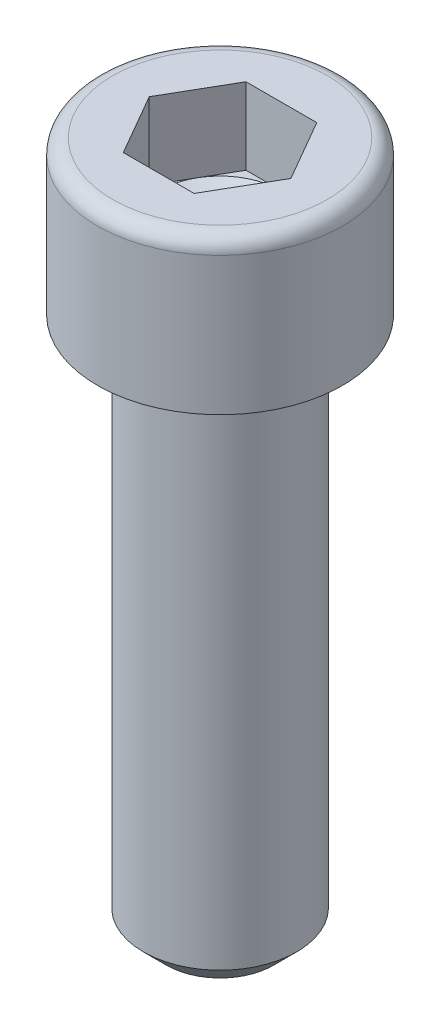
from build123d import *

# Parameters (mm, degrees)
TIGE_START              = -35
ESQUISSE1_R             = 5
TIGE_DEPTH              = 35
CHANFREIN_D_ENTR_E_SIZE = 1.5
HEXAGONE_DEPTH          = 5


with BuildPart() as part:
    # Esquisse1 → Tige (new body)
    with BuildSketch(Plane(origin=(0, 0, 0), x_dir=(1, 0, 0), z_dir=(0, 1, 0)).offset(TIGE_START)):
        with Locations(Location((0, 0, 0), (0, 0, 270))):
            Circle(ESQUISSE1_R)
    extrude(amount=TIGE_DEPTH)

    # Chanfrein d_entr_e
    chanfrein_d_entr_e_edges = [part.edges().sort_by_distance(p)[0] for p in [
        (0, -35, -5),
    ]]
    chamfer(chanfrein_d_entr_e_edges, length=CHANFREIN_D_ENTR_E_SIZE)

    # Esquisse2 → T_te (revolve)
    with BuildSketch(Plane.XY, mode=Mode.PRIVATE) as t_te_sk:
        with BuildLine():
            Line((4, 10), (4, 5))
            Line((4, 5), (0, 2.690598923))
            Line((0, 2.690598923), (0, 0))
            Line((0, 0), (8, 0))
            Line((8, 0), (8, 9))
            ThreePointArc((8, 9), (7.707106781, 9.707106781), (7, 10))
            Line((7, 10), (4, 10))
        make_face()
    revolve(t_te_sk.sketch.rotate(Axis((0, 10, 0), (0, -1, 0)), 180), axis=Axis((0, 10, 0), (0, -1, 0)))

    # Esquisse3 → Hexagone (cut)
    with BuildSketch(Plane(origin=(0, 10, -3), x_dir=(1, 0, 0), z_dir=(0, -1, 0))):
        Polygon((2.309401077, 7), (-2.309401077, 7), (-4.618802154, 3), (-2.309401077, -1), (2.309401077, -1), (4.618802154, 3), align=None)
    extrude(amount=HEXAGONE_DEPTH, mode=Mode.SUBTRACT)


solid = part.part
